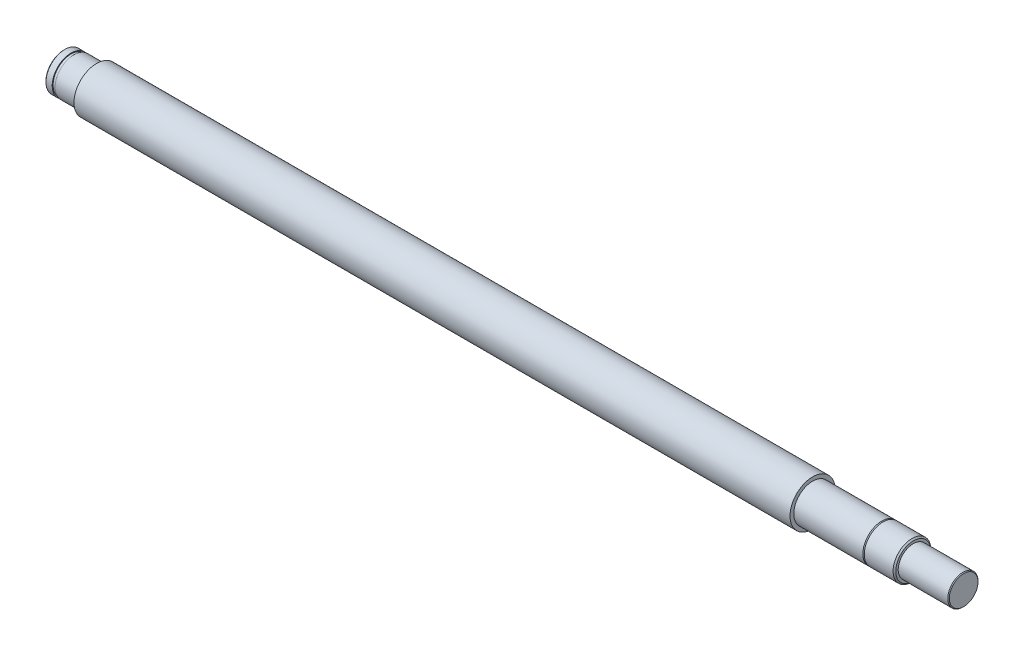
from build123d import *


with BuildPart() as part:
    # Esquisse1 → R_volution1 (revolve)
    with BuildSketch(Plane.XY, mode=Mode.PRIVATE) as r_volution1_sk:
        Polygon((-70.5, 7.125), (-70.5, 0), (287, 0), (287, 5.7), (286.7, 6), (267, 6), (267, 6.95875), (266.45875, 7.5), (255, 7.5), (255, 6.95875), (254.45875, 7.5), (227, 7.5), (227, 9), (-57.5, 9), (-57.5, 7.5), (-66.5, 7.5), (-66.5, 7.15), (-67.65, 7.15), (-67.65, 7.5), (-70.125, 7.5), align=None)
    revolve(r_volution1_sk.sketch.rotate(Axis((-70.5, 0, 0), (1, 0, 0)), 270), axis=Axis((-70.5, 0, 0), (1, 0, 0)))


solid = part.part
